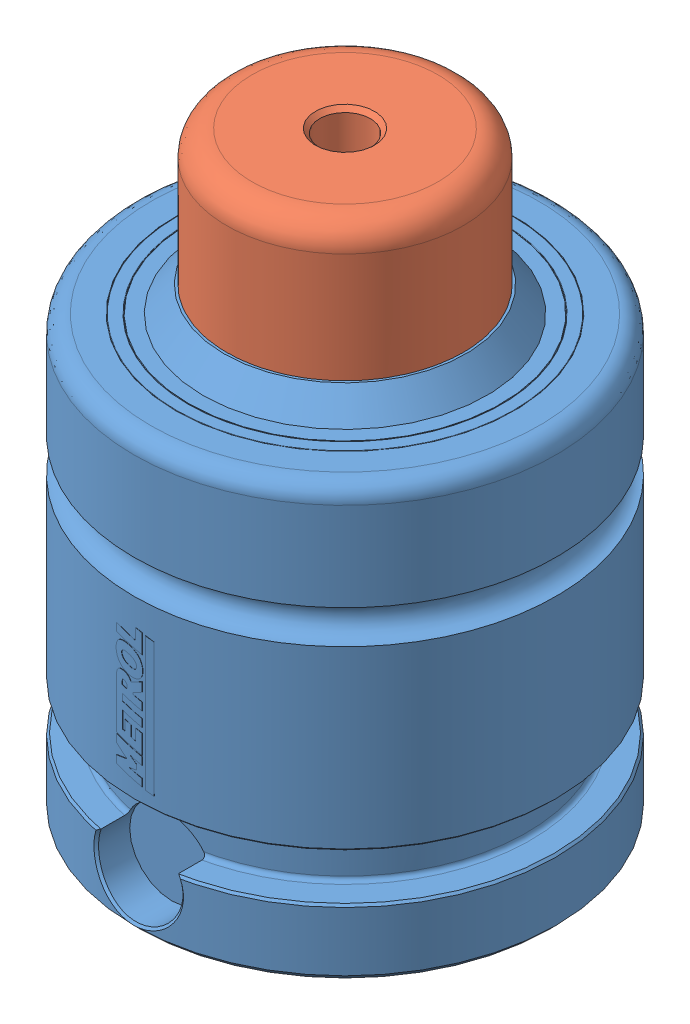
SolidWorks assembly EX1000-016.SLDASM, configuration Default (file format 7000). Lengths in mm.
Overall size (56.42 70 56.42).
2 component instances, 2 part files, 5 mates.
Components (placement in the parent):
- EX-1000 Body-1: EX-1000 Body.SLDPRT [EX-1000-016] x (0 0 1) z (0 -1 0) size (50.1 50 54)
- EX-1000 Piston-1: EX-1000 Piston.SLDPRT [EX-1000-016] at (0 36 0) x (0.654869 0 0.755742) z (0 -1 0) size (40 40 34)
Mates (geometry in assembly coordinates):
- Concentric1: concentric aligned: cylinder of EX-1000 Body-1 through (0 0 0) axis (0 -1 0) radius 14; cylinder of EX-1000 Piston-1 through (0 36 0) axis (0 -1 0) radius 14
- LimitDistance1: limit distance anti-aligned: plane of EX-1000 Piston-1 through (-15.1148 41 13.0974) normal (0 1 0); plane of EX-1000 Body-1 through (-14 41 0) normal (0 -1 0)
- Coincident1: coincident anti-aligned: plane of EX-1000 Body-1 through (0 0 0) normal (0 -1 0); plane of assembly through (0 0 0) normal (0 1 0)
- Coincident2: coincident anti-aligned: plane of EX-1000 Body-1; plane of assembly through (0 0 0) normal (1 0 0)
- Coincident3: coincident aligned: plane of EX-1000 Body-1; plane of assembly through (0 0 0) normal (0 0 1)
